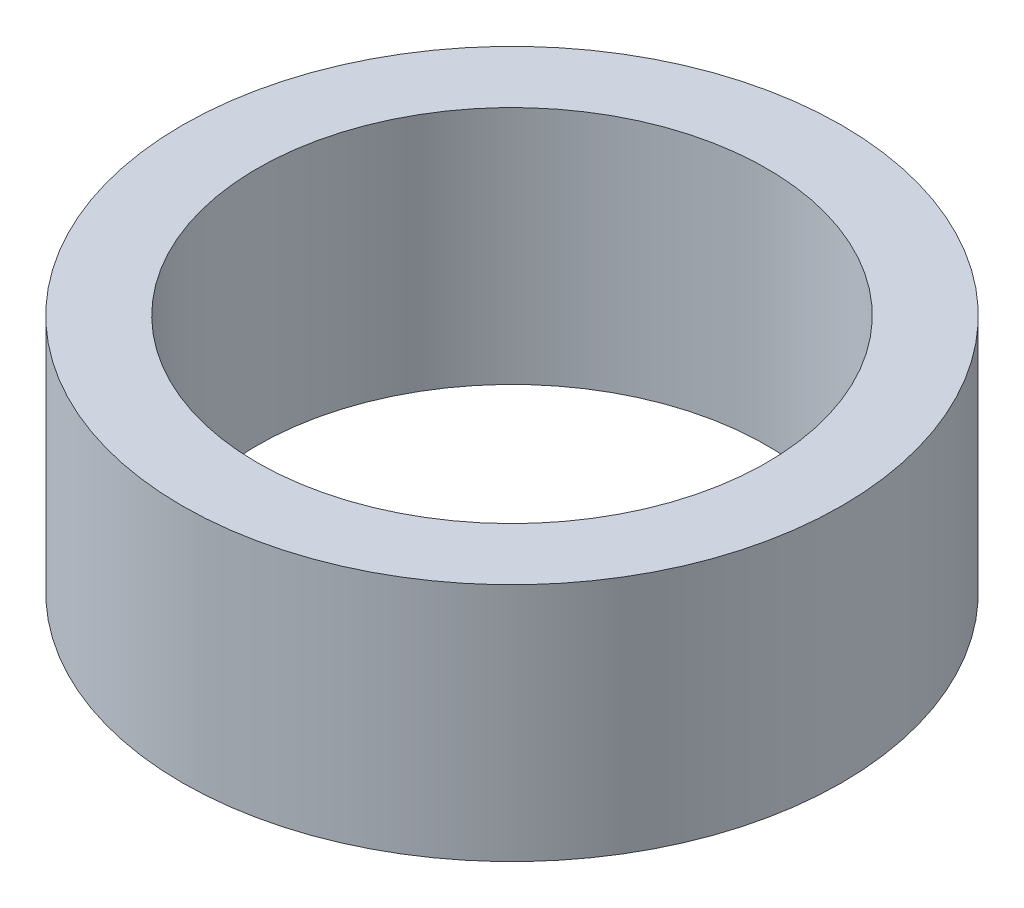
from build123d import *

# Parameters (mm, degrees)
ESQUISSE1_W = 2.5
ESQUISSE1_H = 8


with BuildPart() as part:
    # Esquisse1 → Base-R_volution (revolve)
    with BuildSketch(Plane.XY, mode=Mode.PRIVATE) as base_r_volution_sk:
        with Locations((9.75, 46)):
            Rectangle(ESQUISSE1_W, ESQUISSE1_H)
    revolve(base_r_volution_sk.sketch.rotate(Axis((0, 90, 0), (0, -1, 0)), 90), axis=Axis((0, 90, 0), (0, -1, 0)))


solid = part.part
